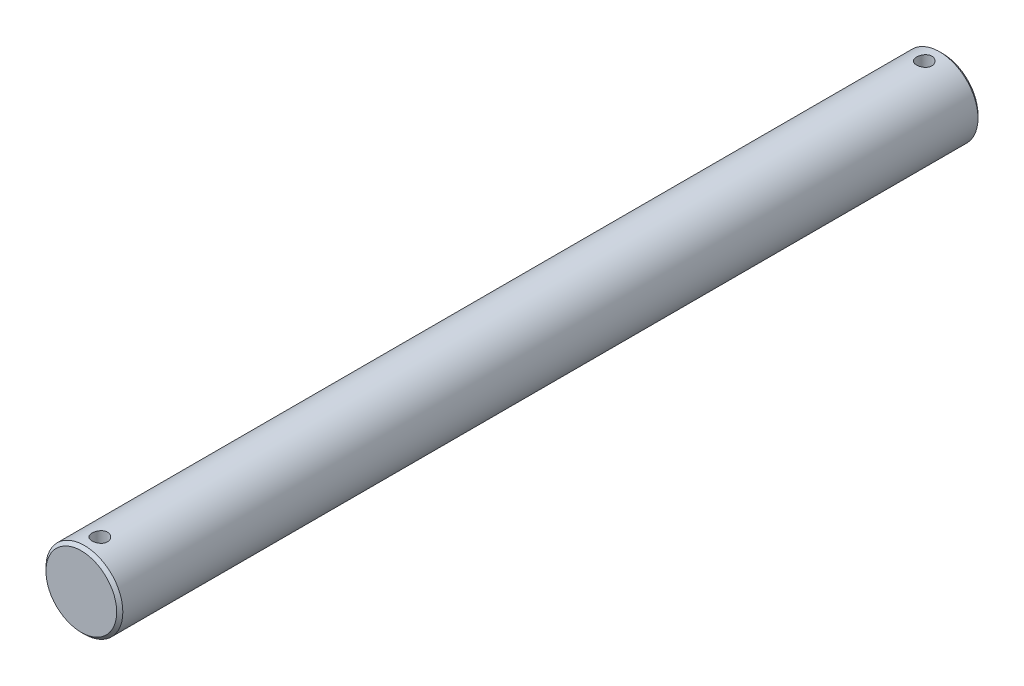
from build123d import *

# Parameters (mm, degrees)
EXTRUSION1_DEPTH             = 140
EXTRUSION1_DEPTH_BACK        = 140
ESQUISSE1_R                  = 12.5
CHANFREIN1_SIZE              = 1
ENL_V_MAT_EXTRU_1_DEPTH      = 47
ENL_V_MAT_EXTRU_1_DEPTH_BACK = 61
ESQUISSE2_R                  = 2.5


with BuildPart() as part:
    # Esquisse1 → Extrusion1 (new, two sides: drawn at the far end of the back side and taken through both)
    with BuildSketch(Plane.XY.offset(-EXTRUSION1_DEPTH_BACK)):
        Circle(ESQUISSE1_R)
    extrude(amount=EXTRUSION1_DEPTH + EXTRUSION1_DEPTH_BACK)

    # Chanfrein1
    chanfrein1_edges = [part.edges().sort_by_distance(p)[0] for p in [
        (-12.5, 0, -140),
        (-12.5, 0, 140),
    ]]
    chamfer(chanfrein1_edges, length=CHANFREIN1_SIZE)

    # Esquisse2 → Enl_v. mat.-Extru.1 (cut, two sides: drawn at the far end of the back side and taken through both)
    with BuildSketch(Plane(origin=(0, 0, 0), x_dir=(1, 0, 0), z_dir=(0, 1, 0)).offset(-ENL_V_MAT_EXTRU_1_DEPTH_BACK)):
        with Locations(Location((0, 134, 0), (0, 0, 270))):
            Circle(ESQUISSE2_R)
        with Locations(Location((0, -134, 0), (0, 0, 270))):
            Circle(ESQUISSE2_R)
    extrude(amount=ENL_V_MAT_EXTRU_1_DEPTH + ENL_V_MAT_EXTRU_1_DEPTH_BACK, mode=Mode.SUBTRACT)


solid = part.part
